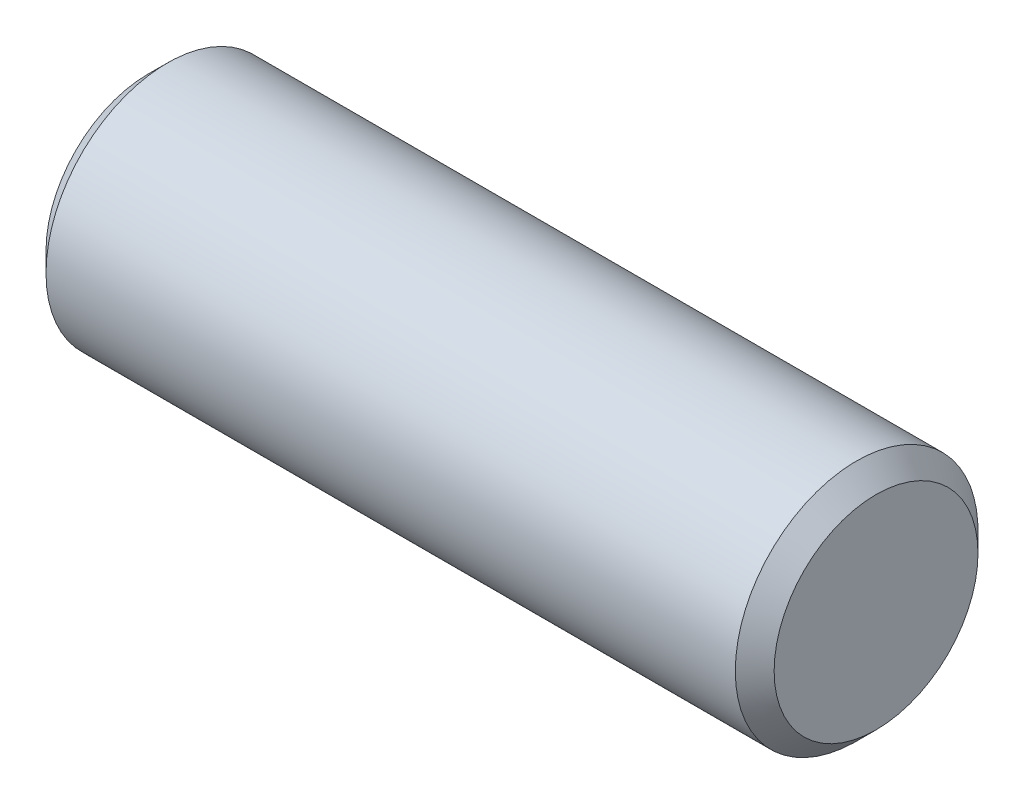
ISO-10303-21;
HEADER;
FILE_DESCRIPTION(('STEP AP214'),'2;1');
FILE_NAME('part.step','',(''),(''),'','','');
FILE_SCHEMA(('AUTOMOTIVE_DESIGN { 1 0 10303 214 1 1 1 1 }'));
ENDSEC;
DATA;
#1=APPLICATION_CONTEXT('core data for automotive mechanical design processes');
#2=APPLICATION_PROTOCOL_DEFINITION('international standard','automotive_design',2000,#1);
#3=PRODUCT_CONTEXT('',#1,'mechanical');
#4=PRODUCT('Part','Part','',(#3));
#5=PRODUCT_RELATED_PRODUCT_CATEGORY('part','',(#4));
#6=PRODUCT_DEFINITION_FORMATION('','',#4);
#7=PRODUCT_DEFINITION_CONTEXT('part definition',#1,'design');
#8=PRODUCT_DEFINITION('design','',#6,#7);
#9=PRODUCT_DEFINITION_SHAPE('','',#8);
#10=(LENGTH_UNIT() NAMED_UNIT(*) SI_UNIT(.MILLI.,.METRE.));
#11=(NAMED_UNIT(*) PLANE_ANGLE_UNIT() SI_UNIT($,.RADIAN.));
#12=(NAMED_UNIT(*) SI_UNIT($,.STERADIAN.) SOLID_ANGLE_UNIT());
#13=UNCERTAINTY_MEASURE_WITH_UNIT(LENGTH_MEASURE(1.E-05),#10,'distance_accuracy_value','');
#14=(GEOMETRIC_REPRESENTATION_CONTEXT(3) GLOBAL_UNCERTAINTY_ASSIGNED_CONTEXT((#13)) GLOBAL_UNIT_ASSIGNED_CONTEXT((#10,
#11,#12)) REPRESENTATION_CONTEXT('',''));
#15=CARTESIAN_POINT('',(0.,0.,0.));
#16=DIRECTION('',(0.,0.,1.));
#17=DIRECTION('',(1.,0.,0.));
#18=AXIS2_PLACEMENT_3D('',#15,#16,#17);
#19=CARTESIAN_POINT('',(9.525,0.,0.));
#20=DIRECTION('',(-1.,0.,0.));
#21=DIRECTION('',(0.,0.,1.));
#22=AXIS2_PLACEMENT_3D('',#19,#20,#21);
#23=CYLINDRICAL_SURFACE('',#22,3.17499999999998);
#24=CARTESIAN_POINT('',(9.017,0.,0.));
#25=DIRECTION('',(1.,0.,0.));
#26=DIRECTION('',(0.,0.,-1.));
#27=AXIS2_PLACEMENT_3D('',#24,#25,#26);
#28=CIRCLE('',#27,3.17499999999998);
#29=CARTESIAN_POINT('',(9.017,0.,3.17499999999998));
#30=VERTEX_POINT('',#29);
#31=EDGE_CURVE('E38',#30,#30,#28,.F.);
#32=CARTESIAN_POINT('',(-9.017,0.,0.));
#33=DIRECTION('',(1.,0.,0.));
#34=DIRECTION('',(0.,0.,-1.));
#35=AXIS2_PLACEMENT_3D('',#32,#33,#34);
#36=CIRCLE('',#35,3.17499999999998);
#37=CARTESIAN_POINT('',(-9.017,0.,3.17499999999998));
#38=VERTEX_POINT('',#37);
#39=EDGE_CURVE('E42',#38,#38,#36,.T.);
#40=CARTESIAN_POINT('',(9.017,0.,3.17499999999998));
#41=CARTESIAN_POINT('',(8.82914583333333,0.,3.17499999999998));
#42=CARTESIAN_POINT('',(8.64129166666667,0.,3.17499999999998));
#43=CARTESIAN_POINT('',(8.26558333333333,0.,3.17499999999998));
#44=CARTESIAN_POINT('',(8.07772916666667,0.,3.17499999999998));
#45=CARTESIAN_POINT('',(7.70202083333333,0.,3.17499999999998));
#46=CARTESIAN_POINT('',(7.51416666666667,0.,3.17499999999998));
#47=CARTESIAN_POINT('',(7.13845833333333,0.,3.17499999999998));
#48=CARTESIAN_POINT('',(6.95060416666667,0.,3.17499999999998));
#49=CARTESIAN_POINT('',(6.57489583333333,0.,3.17499999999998));
#50=CARTESIAN_POINT('',(6.38704166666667,0.,3.17499999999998));
#51=CARTESIAN_POINT('',(6.01133333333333,0.,3.17499999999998));
#52=CARTESIAN_POINT('',(5.82347916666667,0.,3.17499999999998));
#53=CARTESIAN_POINT('',(5.44777083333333,0.,3.17499999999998));
#54=CARTESIAN_POINT('',(5.25991666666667,0.,3.17499999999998));
#55=CARTESIAN_POINT('',(4.88420833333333,0.,3.17499999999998));
#56=CARTESIAN_POINT('',(4.69635416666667,0.,3.17499999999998));
#57=CARTESIAN_POINT('',(4.32064583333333,0.,3.17499999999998));
#58=CARTESIAN_POINT('',(4.13279166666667,0.,3.17499999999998));
#59=CARTESIAN_POINT('',(3.75708333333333,0.,3.17499999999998));
#60=CARTESIAN_POINT('',(3.56922916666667,0.,3.17499999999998));
#61=CARTESIAN_POINT('',(3.19352083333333,0.,3.17499999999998));
#62=CARTESIAN_POINT('',(3.00566666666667,0.,3.17499999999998));
#63=CARTESIAN_POINT('',(2.62995833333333,0.,3.17499999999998));
#64=CARTESIAN_POINT('',(2.44210416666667,0.,3.17499999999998));
#65=CARTESIAN_POINT('',(2.06639583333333,0.,3.17499999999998));
#66=CARTESIAN_POINT('',(1.87854166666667,0.,3.17499999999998));
#67=CARTESIAN_POINT('',(1.50283333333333,0.,3.17499999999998));
#68=CARTESIAN_POINT('',(1.31497916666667,0.,3.17499999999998));
#69=CARTESIAN_POINT('',(0.939270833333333,0.,3.17499999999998));
#70=CARTESIAN_POINT('',(0.751416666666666,0.,3.17499999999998));
#71=CARTESIAN_POINT('',(0.375708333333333,0.,3.17499999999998));
#72=CARTESIAN_POINT('',(0.187854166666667,0.,3.17499999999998));
#73=CARTESIAN_POINT('',(-0.187854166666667,0.,3.17499999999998));
#74=CARTESIAN_POINT('',(-0.375708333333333,0.,3.17499999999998));
#75=CARTESIAN_POINT('',(-0.751416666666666,0.,3.17499999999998));
#76=CARTESIAN_POINT('',(-0.939270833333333,0.,3.17499999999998));
#77=CARTESIAN_POINT('',(-1.31497916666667,0.,3.17499999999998));
#78=CARTESIAN_POINT('',(-1.50283333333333,0.,3.17499999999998));
#79=CARTESIAN_POINT('',(-1.87854166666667,0.,3.17499999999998));
#80=CARTESIAN_POINT('',(-2.06639583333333,0.,3.17499999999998));
#81=CARTESIAN_POINT('',(-2.44210416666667,0.,3.17499999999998));
#82=CARTESIAN_POINT('',(-2.62995833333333,0.,3.17499999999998));
#83=CARTESIAN_POINT('',(-3.00566666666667,0.,3.17499999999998));
#84=CARTESIAN_POINT('',(-3.19352083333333,0.,3.17499999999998));
#85=CARTESIAN_POINT('',(-3.56922916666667,0.,3.17499999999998));
#86=CARTESIAN_POINT('',(-3.75708333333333,0.,3.17499999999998));
#87=CARTESIAN_POINT('',(-4.13279166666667,0.,3.17499999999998));
#88=CARTESIAN_POINT('',(-4.32064583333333,0.,3.17499999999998));
#89=CARTESIAN_POINT('',(-4.69635416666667,0.,3.17499999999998));
#90=CARTESIAN_POINT('',(-4.88420833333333,0.,3.17499999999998));
#91=CARTESIAN_POINT('',(-5.25991666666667,0.,3.17499999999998));
#92=CARTESIAN_POINT('',(-5.44777083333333,0.,3.17499999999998));
#93=CARTESIAN_POINT('',(-5.82347916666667,0.,3.17499999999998));
#94=CARTESIAN_POINT('',(-6.01133333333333,0.,3.17499999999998));
#95=CARTESIAN_POINT('',(-6.38704166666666,0.,3.17499999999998));
#96=CARTESIAN_POINT('',(-6.57489583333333,0.,3.17499999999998));
#97=CARTESIAN_POINT('',(-6.95060416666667,0.,3.17499999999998));
#98=CARTESIAN_POINT('',(-7.13845833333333,0.,3.17499999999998));
#99=CARTESIAN_POINT('',(-7.51416666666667,0.,3.17499999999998));
#100=CARTESIAN_POINT('',(-7.70202083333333,0.,3.17499999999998));
#101=CARTESIAN_POINT('',(-8.07772916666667,0.,3.17499999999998));
#102=CARTESIAN_POINT('',(-8.26558333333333,0.,3.17499999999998));
#103=CARTESIAN_POINT('',(-8.64129166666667,0.,3.17499999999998));
#104=CARTESIAN_POINT('',(-8.82914583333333,0.,3.17499999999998));
#105=CARTESIAN_POINT('',(-9.017,0.,3.17499999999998));
#106=B_SPLINE_CURVE_WITH_KNOTS('',3,(#40,#41,#42,#43,#44,#45,#46,#47,#48,#49,#50,#51,#52,#53,
#54,#55,#56,#57,#58,#59,#60,#61,#62,#63,#64,#65,#66,#67,#68,#69,#70,#71,#72,#73,#74,#75,#76,#77,
#78,#79,#80,#81,#82,#83,#84,#85,#86,#87,#88,#89,#90,#91,#92,#93,#94,#95,#96,#97,#98,#99,#100,
#101,#102,#103,#104,#105),.UNSPECIFIED.,.F.,.F.,(4,2,2,2,2,2,2,2,2,2,2,2,2,2,2,2,2,2,2,2,2,2,2,
2,2,2,2,2,2,2,2,2,4),(0.,0.5635625,1.127125,1.6906875,2.25425,2.8178125,3.381375,3.9449375,
4.5085,5.0720625,5.635625,6.1991875,6.76275,7.3263125,7.889875,8.4534375,9.017,9.5805625,
10.144125,10.7076875,11.27125,11.8348125,12.398375,12.9619375,13.5255,14.0890625,14.652625,
15.2161875,15.77975,16.3433125,16.906875,17.4704375,18.034),.UNSPECIFIED.);
#107=EDGE_CURVE('BSEAM31',#30,#38,#106,.T.);
#108=ORIENTED_EDGE('',*,*,#31,.T.);
#109=ORIENTED_EDGE('',*,*,#39,.T.);
#110=ORIENTED_EDGE('',*,*,#107,.T.);
#111=ORIENTED_EDGE('',*,*,#107,.F.);
#112=EDGE_LOOP('',(#108,#110,#109,#111));
#113=FACE_BOUND('',#112,.T.);
#114=ADVANCED_FACE('F31',(#113),#23,.T.);
#115=CARTESIAN_POINT('',(9.525,0.,0.));
#116=DIRECTION('',(1.,0.,0.));
#117=DIRECTION('',(0.,0.,-1.));
#118=AXIS2_PLACEMENT_3D('',#115,#116,#117);
#119=PLANE('',#118);
#120=CARTESIAN_POINT('',(9.525,0.,0.));
#121=DIRECTION('',(1.,0.,0.));
#122=DIRECTION('',(0.,0.,-1.));
#123=AXIS2_PLACEMENT_3D('',#120,#121,#122);
#124=CIRCLE('',#123,2.66699999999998);
#125=CARTESIAN_POINT('',(9.525,0.,-2.66699999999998));
#126=VERTEX_POINT('',#125);
#127=EDGE_CURVE('E46',#126,#126,#124,.T.);
#128=ORIENTED_EDGE('',*,*,#127,.T.);
#129=EDGE_LOOP('',(#128));
#130=FACE_BOUND('',#129,.T.);
#131=ADVANCED_FACE('F52',(#130),#119,.T.);
#132=CARTESIAN_POINT('',(-9.525,0.,0.));
#133=DIRECTION('',(1.,0.,0.));
#134=DIRECTION('',(0.,0.,-1.));
#135=AXIS2_PLACEMENT_3D('',#132,#133,#134);
#136=PLANE('',#135);
#137=CARTESIAN_POINT('',(-9.525,0.,0.));
#138=DIRECTION('',(1.,0.,0.));
#139=DIRECTION('',(0.,0.,-1.));
#140=AXIS2_PLACEMENT_3D('',#137,#138,#139);
#141=CIRCLE('',#140,2.66699999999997);
#142=CARTESIAN_POINT('',(-9.525,0.,-2.66699999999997));
#143=VERTEX_POINT('',#142);
#144=EDGE_CURVE('E10',#143,#143,#141,.F.);
#145=ORIENTED_EDGE('',*,*,#144,.T.);
#146=EDGE_LOOP('',(#145));
#147=FACE_BOUND('',#146,.T.);
#148=ADVANCED_FACE('F56',(#147),#136,.F.);
#149=CARTESIAN_POINT('',(9.525,0.,0.));
#150=DIRECTION('',(-1.,0.,0.));
#151=DIRECTION('',(0.,0.,1.));
#152=AXIS2_PLACEMENT_3D('',#149,#150,#151);
#153=CONICAL_SURFACE('',#152,2.66699999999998,0.785398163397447);
#154=ORIENTED_EDGE('',*,*,#31,.F.);
#155=EDGE_LOOP('',(#154));
#156=FACE_BOUND('',#155,.T.);
#157=ORIENTED_EDGE('',*,*,#127,.F.);
#158=EDGE_LOOP('',(#157));
#159=FACE_BOUND('',#158,.T.);
#160=ADVANCED_FACE('F54',(#156,#159),#153,.T.);
#161=CARTESIAN_POINT('',(-9.017,0.,0.));
#162=DIRECTION('',(1.,0.,0.));
#163=DIRECTION('',(0.,0.,-1.));
#164=AXIS2_PLACEMENT_3D('',#161,#162,#163);
#165=CONICAL_SURFACE('',#164,3.17499999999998,0.785398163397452);
#166=ORIENTED_EDGE('',*,*,#144,.F.);
#167=EDGE_LOOP('',(#166));
#168=FACE_BOUND('',#167,.T.);
#169=ORIENTED_EDGE('',*,*,#39,.F.);
#170=EDGE_LOOP('',(#169));
#171=FACE_BOUND('',#170,.T.);
#172=ADVANCED_FACE('F33',(#168,#171),#165,.T.);
#173=CLOSED_SHELL('',(#114,#131,#148,#160,#172));
#174=MANIFOLD_SOLID_BREP('B2',#173);
#175=ADVANCED_BREP_SHAPE_REPRESENTATION('',(#18,#174),#14);
#176=SHAPE_DEFINITION_REPRESENTATION(#9,#175);
ENDSEC;
END-ISO-10303-21;
